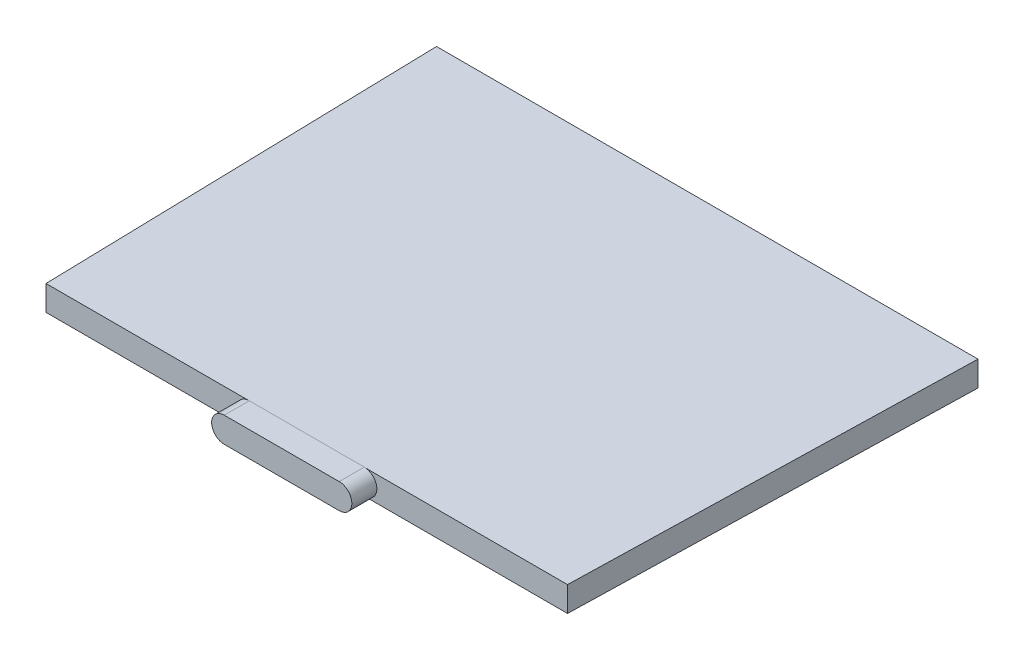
ISO-10303-21;
HEADER;
FILE_DESCRIPTION(('STEP AP214'),'2;1');
FILE_NAME('part.step','',(''),(''),'','','');
FILE_SCHEMA(('AUTOMOTIVE_DESIGN { 1 0 10303 214 1 1 1 1 }'));
ENDSEC;
DATA;
#1=APPLICATION_CONTEXT('core data for automotive mechanical design processes');
#2=APPLICATION_PROTOCOL_DEFINITION('international standard','automotive_design',2000,#1);
#3=PRODUCT_CONTEXT('',#1,'mechanical');
#4=PRODUCT('Part','Part','',(#3));
#5=PRODUCT_RELATED_PRODUCT_CATEGORY('part','',(#4));
#6=PRODUCT_DEFINITION_FORMATION('','',#4);
#7=PRODUCT_DEFINITION_CONTEXT('part definition',#1,'design');
#8=PRODUCT_DEFINITION('design','',#6,#7);
#9=PRODUCT_DEFINITION_SHAPE('','',#8);
#10=(LENGTH_UNIT() NAMED_UNIT(*) SI_UNIT(.MILLI.,.METRE.));
#11=(NAMED_UNIT(*) PLANE_ANGLE_UNIT() SI_UNIT($,.RADIAN.));
#12=(NAMED_UNIT(*) SI_UNIT($,.STERADIAN.) SOLID_ANGLE_UNIT());
#13=UNCERTAINTY_MEASURE_WITH_UNIT(LENGTH_MEASURE(1.E-05),#10,'distance_accuracy_value','');
#14=(GEOMETRIC_REPRESENTATION_CONTEXT(3) GLOBAL_UNCERTAINTY_ASSIGNED_CONTEXT((#13)) GLOBAL_UNIT_ASSIGNED_CONTEXT((#10,
#11,#12)) REPRESENTATION_CONTEXT('',''));
#15=CARTESIAN_POINT('',(0.,0.,0.));
#16=DIRECTION('',(0.,0.,1.));
#17=DIRECTION('',(1.,0.,0.));
#18=AXIS2_PLACEMENT_3D('',#15,#16,#17);
#19=CARTESIAN_POINT('',(-130.22,12.5,200.));
#20=DIRECTION('',(0.,0.,-1.));
#21=DIRECTION('',(-1.,0.,0.));
#22=AXIS2_PLACEMENT_3D('',#19,#20,#21);
#23=PLANE('',#22);
#24=CARTESIAN_POINT('',(-28.7,6.24999999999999,200.));
#25=DIRECTION('',(0.,0.,1.));
#26=DIRECTION('',(1.,0.,0.));
#27=AXIS2_PLACEMENT_3D('',#24,#25,#26);
#28=CIRCLE('',#27,6.3);
#29=CARTESIAN_POINT('',(-29.4921489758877,12.5,200.));
#30=VERTEX_POINT('',#29);
#31=CARTESIAN_POINT('',(-29.4921489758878,0.,200.));
#32=VERTEX_POINT('',#31);
#33=EDGE_CURVE('E11',#30,#32,#28,.T.);
#34=ORIENTED_EDGE('',*,*,#33,.F.);
#35=DIRECTION('',(1.,0.,0.));
#36=VECTOR('',#35,1.);
#37=CARTESIAN_POINT('',(-130.22,12.5,200.));
#38=LINE('',#37,#36);
#39=CARTESIAN_POINT('',(-130.22,12.5,200.));
#40=VERTEX_POINT('',#39);
#41=EDGE_CURVE('E156',#40,#30,#38,.T.);
#42=ORIENTED_EDGE('',*,*,#41,.F.);
#43=DIRECTION('',(0.,-1.,0.));
#44=VECTOR('',#43,1.);
#45=CARTESIAN_POINT('',(-130.22,12.5,200.));
#46=LINE('',#45,#44);
#47=CARTESIAN_POINT('',(-130.22,0.,200.));
#48=VERTEX_POINT('',#47);
#49=EDGE_CURVE('E168',#40,#48,#46,.T.);
#50=ORIENTED_EDGE('',*,*,#49,.T.);
#51=DIRECTION('',(1.,0.,0.));
#52=VECTOR('',#51,1.);
#53=CARTESIAN_POINT('',(-130.22,0.,200.));
#54=LINE('',#53,#52);
#55=EDGE_CURVE('E151',#48,#32,#54,.T.);
#56=ORIENTED_EDGE('',*,*,#55,.T.);
#57=EDGE_LOOP('',(#34,#42,#50,#56));
#58=FACE_BOUND('',#57,.T.);
#59=ADVANCED_FACE('F32',(#58),#23,.F.);
#60=CARTESIAN_POINT('',(135.195,12.5,0.));
#61=DIRECTION('',(-0.999690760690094,0.,-0.0248673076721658));
#62=DIRECTION('',(-0.0248673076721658,0.,0.999690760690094));
#63=AXIS2_PLACEMENT_3D('',#60,#61,#62);
#64=PLANE('',#63);
#65=DIRECTION('',(0.0248673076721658,0.,-0.999690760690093));
#66=VECTOR('',#65,1.);
#67=CARTESIAN_POINT('',(135.195,0.,0.));
#68=LINE('',#67,#66);
#69=CARTESIAN_POINT('',(130.22,0.,200.));
#70=VERTEX_POINT('',#69);
#71=CARTESIAN_POINT('',(135.195,0.,0.));
#72=VERTEX_POINT('',#71);
#73=EDGE_CURVE('E138',#70,#72,#68,.T.);
#74=ORIENTED_EDGE('',*,*,#73,.T.);
#75=DIRECTION('',(0.,-1.,0.));
#76=VECTOR('',#75,1.);
#77=CARTESIAN_POINT('',(135.195,12.5,0.));
#78=LINE('',#77,#76);
#79=CARTESIAN_POINT('',(135.195,12.5,0.));
#80=VERTEX_POINT('',#79);
#81=EDGE_CURVE('E36',#80,#72,#78,.T.);
#82=ORIENTED_EDGE('',*,*,#81,.F.);
#83=DIRECTION('',(0.0248673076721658,0.,-0.999690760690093));
#84=VECTOR('',#83,1.);
#85=CARTESIAN_POINT('',(135.195,12.5,0.));
#86=LINE('',#85,#84);
#87=CARTESIAN_POINT('',(130.22,12.5,200.));
#88=VERTEX_POINT('',#87);
#89=EDGE_CURVE('E147',#88,#80,#86,.T.);
#90=ORIENTED_EDGE('',*,*,#89,.F.);
#91=DIRECTION('',(0.,-1.,0.));
#92=VECTOR('',#91,1.);
#93=CARTESIAN_POINT('',(130.22,12.5,200.));
#94=LINE('',#93,#92);
#95=EDGE_CURVE('E157',#88,#70,#94,.T.);
#96=ORIENTED_EDGE('',*,*,#95,.T.);
#97=EDGE_LOOP('',(#74,#82,#90,#96));
#98=FACE_BOUND('',#97,.T.);
#99=ADVANCED_FACE('F34',(#98),#64,.F.);
#100=CARTESIAN_POINT('',(135.195,12.5,0.));
#101=DIRECTION('',(0.,0.,1.));
#102=DIRECTION('',(1.,0.,0.));
#103=AXIS2_PLACEMENT_3D('',#100,#101,#102);
#104=PLANE('',#103);
#105=DIRECTION('',(-1.,0.,0.));
#106=VECTOR('',#105,1.);
#107=CARTESIAN_POINT('',(135.195,0.,0.));
#108=LINE('',#107,#106);
#109=CARTESIAN_POINT('',(-135.195,0.,0.));
#110=VERTEX_POINT('',#109);
#111=EDGE_CURVE('E141',#72,#110,#108,.T.);
#112=ORIENTED_EDGE('',*,*,#111,.T.);
#113=DIRECTION('',(0.,-1.,0.));
#114=VECTOR('',#113,1.);
#115=CARTESIAN_POINT('',(-135.195,12.5,0.));
#116=LINE('',#115,#114);
#117=CARTESIAN_POINT('',(-135.195,12.5,0.));
#118=VERTEX_POINT('',#117);
#119=EDGE_CURVE('E170',#118,#110,#116,.T.);
#120=ORIENTED_EDGE('',*,*,#119,.F.);
#121=DIRECTION('',(-1.,0.,0.));
#122=VECTOR('',#121,1.);
#123=CARTESIAN_POINT('',(135.195,12.5,0.));
#124=LINE('',#123,#122);
#125=EDGE_CURVE('E150',#80,#118,#124,.T.);
#126=ORIENTED_EDGE('',*,*,#125,.F.);
#127=ORIENTED_EDGE('',*,*,#81,.T.);
#128=EDGE_LOOP('',(#112,#120,#126,#127));
#129=FACE_BOUND('',#128,.T.);
#130=ADVANCED_FACE('F213',(#129),#104,.F.);
#131=CARTESIAN_POINT('',(-135.195,12.5,0.));
#132=DIRECTION('',(0.999690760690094,0.,-0.0248673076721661));
#133=DIRECTION('',(-0.0248673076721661,0.,-0.999690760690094));
#134=AXIS2_PLACEMENT_3D('',#131,#132,#133);
#135=PLANE('',#134);
#136=DIRECTION('',(0.0248673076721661,0.,0.999690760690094));
#137=VECTOR('',#136,1.);
#138=CARTESIAN_POINT('',(-135.195,0.,0.));
#139=LINE('',#138,#137);
#140=EDGE_CURVE('E161',#110,#48,#139,.T.);
#141=ORIENTED_EDGE('',*,*,#140,.T.);
#142=ORIENTED_EDGE('',*,*,#49,.F.);
#143=DIRECTION('',(0.0248673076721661,0.,0.999690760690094));
#144=VECTOR('',#143,1.);
#145=CARTESIAN_POINT('',(-135.195,12.5,0.));
#146=LINE('',#145,#144);
#147=EDGE_CURVE('E153',#118,#40,#146,.T.);
#148=ORIENTED_EDGE('',*,*,#147,.F.);
#149=ORIENTED_EDGE('',*,*,#119,.T.);
#150=EDGE_LOOP('',(#141,#142,#148,#149));
#151=FACE_BOUND('',#150,.T.);
#152=ADVANCED_FACE('F215',(#151),#135,.F.);
#153=CARTESIAN_POINT('',(28.7,6.25,200.));
#154=DIRECTION('',(0.,0.,1.));
#155=DIRECTION('',(1.,0.,0.));
#156=AXIS2_PLACEMENT_3D('',#153,#154,#155);
#157=CIRCLE('',#156,6.3);
#158=CARTESIAN_POINT('',(29.4921489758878,0.,200.));
#159=VERTEX_POINT('',#158);
#160=CARTESIAN_POINT('',(29.4921489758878,12.5,200.));
#161=VERTEX_POINT('',#160);
#162=EDGE_CURVE('E41',#159,#161,#157,.T.);
#163=ORIENTED_EDGE('',*,*,#162,.F.);
#164=EDGE_CURVE('E163',#159,#70,#54,.T.);
#165=ORIENTED_EDGE('',*,*,#164,.T.);
#166=ORIENTED_EDGE('',*,*,#95,.F.);
#167=EDGE_CURVE('E155',#161,#88,#38,.T.);
#168=ORIENTED_EDGE('',*,*,#167,.F.);
#169=EDGE_LOOP('',(#163,#165,#166,#168));
#170=FACE_BOUND('',#169,.T.);
#171=ADVANCED_FACE('F206',(#170),#23,.F.);
#172=CARTESIAN_POINT('',(0.,12.5,0.));
#173=DIRECTION('',(0.,1.,0.));
#174=DIRECTION('',(0.,0.,1.));
#175=AXIS2_PLACEMENT_3D('',#172,#173,#174);
#176=PLANE('',#175);
#177=ORIENTED_EDGE('',*,*,#89,.T.);
#178=ORIENTED_EDGE('',*,*,#125,.T.);
#179=ORIENTED_EDGE('',*,*,#147,.T.);
#180=ORIENTED_EDGE('',*,*,#41,.T.);
#181=EDGE_CURVE('E158',#30,#161,#38,.T.);
#182=ORIENTED_EDGE('',*,*,#181,.T.);
#183=ORIENTED_EDGE('',*,*,#167,.T.);
#184=EDGE_LOOP('',(#177,#178,#179,#180,#182,#183));
#185=FACE_BOUND('',#184,.T.);
#186=ADVANCED_FACE('F204',(#185),#176,.T.);
#187=CARTESIAN_POINT('',(0.,0.,0.));
#188=DIRECTION('',(0.,1.,0.));
#189=DIRECTION('',(0.,0.,1.));
#190=AXIS2_PLACEMENT_3D('',#187,#188,#189);
#191=PLANE('',#190);
#192=ORIENTED_EDGE('',*,*,#73,.F.);
#193=ORIENTED_EDGE('',*,*,#164,.F.);
#194=EDGE_CURVE('E165',#32,#159,#54,.T.);
#195=ORIENTED_EDGE('',*,*,#194,.F.);
#196=ORIENTED_EDGE('',*,*,#55,.F.);
#197=ORIENTED_EDGE('',*,*,#140,.F.);
#198=ORIENTED_EDGE('',*,*,#111,.F.);
#199=EDGE_LOOP('',(#192,#193,#195,#196,#197,#198));
#200=FACE_BOUND('',#199,.T.);
#201=ADVANCED_FACE('F210',(#200),#191,.F.);
#202=CARTESIAN_POINT('',(-28.7,6.24999999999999,200.));
#203=DIRECTION('',(0.,0.,1.));
#204=DIRECTION('',(1.,0.,0.));
#205=AXIS2_PLACEMENT_3D('',#202,#203,#204);
#206=PLANE('',#205);
#207=CARTESIAN_POINT('',(-28.7,-0.0500000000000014,200.));
#208=VERTEX_POINT('',#207);
#209=EDGE_CURVE('E44',#32,#208,#28,.T.);
#210=ORIENTED_EDGE('',*,*,#209,.F.);
#211=ORIENTED_EDGE('',*,*,#194,.T.);
#212=CARTESIAN_POINT('',(28.7,-0.0500000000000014,200.));
#213=VERTEX_POINT('',#212);
#214=EDGE_CURVE('E180',#213,#159,#157,.T.);
#215=ORIENTED_EDGE('',*,*,#214,.F.);
#216=DIRECTION('',(1.,0.,0.));
#217=VECTOR('',#216,1.);
#218=CARTESIAN_POINT('',(-28.7,-0.0500000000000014,200.));
#219=LINE('',#218,#217);
#220=EDGE_CURVE('E186',#208,#213,#219,.T.);
#221=ORIENTED_EDGE('',*,*,#220,.F.);
#222=EDGE_LOOP('',(#210,#211,#215,#221));
#223=FACE_BOUND('',#222,.T.);
#224=ADVANCED_FACE('F218',(#223),#206,.F.);
#225=CARTESIAN_POINT('',(-28.7,6.24999999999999,212.5));
#226=DIRECTION('',(0.,0.,-1.));
#227=DIRECTION('',(-1.,0.,0.));
#228=AXIS2_PLACEMENT_3D('',#225,#226,#227);
#229=CYLINDRICAL_SURFACE('',#228,6.3);
#230=CARTESIAN_POINT('',(-28.7,12.55,200.));
#231=VERTEX_POINT('',#230);
#232=EDGE_CURVE('E43',#231,#30,#28,.T.);
#233=ORIENTED_EDGE('',*,*,#232,.T.);
#234=ORIENTED_EDGE('',*,*,#33,.T.);
#235=ORIENTED_EDGE('',*,*,#209,.T.);
#236=DIRECTION('',(0.,0.,-1.));
#237=VECTOR('',#236,1.);
#238=CARTESIAN_POINT('',(-28.7,-0.0500000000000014,212.5));
#239=LINE('',#238,#237);
#240=CARTESIAN_POINT('',(-28.7,-0.0500000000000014,212.5));
#241=VERTEX_POINT('',#240);
#242=EDGE_CURVE('E117',#241,#208,#239,.T.);
#243=ORIENTED_EDGE('',*,*,#242,.F.);
#244=CARTESIAN_POINT('',(-28.7,6.24999999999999,212.5));
#245=DIRECTION('',(0.,0.,1.));
#246=DIRECTION('',(1.,0.,0.));
#247=AXIS2_PLACEMENT_3D('',#244,#245,#246);
#248=CIRCLE('',#247,6.3);
#249=CARTESIAN_POINT('',(-28.7,12.55,212.5));
#250=VERTEX_POINT('',#249);
#251=EDGE_CURVE('E123',#250,#241,#248,.T.);
#252=ORIENTED_EDGE('',*,*,#251,.F.);
#253=DIRECTION('',(0.,0.,-1.));
#254=VECTOR('',#253,1.);
#255=CARTESIAN_POINT('',(-28.7,12.55,212.5));
#256=LINE('',#255,#254);
#257=EDGE_CURVE('E192',#250,#231,#256,.T.);
#258=ORIENTED_EDGE('',*,*,#257,.T.);
#259=EDGE_LOOP('',(#233,#234,#235,#243,#252,#258));
#260=FACE_BOUND('',#259,.T.);
#261=ADVANCED_FACE('F135',(#260),#229,.T.);
#262=CARTESIAN_POINT('',(-28.7,-0.0500000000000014,212.5));
#263=DIRECTION('',(0.,1.,0.));
#264=DIRECTION('',(-1.,0.,0.));
#265=AXIS2_PLACEMENT_3D('',#262,#263,#264);
#266=PLANE('',#265);
#267=ORIENTED_EDGE('',*,*,#220,.T.);
#268=DIRECTION('',(0.,0.,-1.));
#269=VECTOR('',#268,1.);
#270=CARTESIAN_POINT('',(28.7,-0.0500000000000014,212.5));
#271=LINE('',#270,#269);
#272=CARTESIAN_POINT('',(28.7,-0.0500000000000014,212.5));
#273=VERTEX_POINT('',#272);
#274=EDGE_CURVE('E119',#273,#213,#271,.T.);
#275=ORIENTED_EDGE('',*,*,#274,.F.);
#276=DIRECTION('',(1.,0.,0.));
#277=VECTOR('',#276,1.);
#278=CARTESIAN_POINT('',(-28.7,-0.0500000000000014,212.5));
#279=LINE('',#278,#277);
#280=EDGE_CURVE('E113',#241,#273,#279,.T.);
#281=ORIENTED_EDGE('',*,*,#280,.F.);
#282=ORIENTED_EDGE('',*,*,#242,.T.);
#283=EDGE_LOOP('',(#267,#275,#281,#282));
#284=FACE_BOUND('',#283,.T.);
#285=ADVANCED_FACE('F115',(#284),#266,.F.);
#286=CARTESIAN_POINT('',(28.7,6.25,212.5));
#287=DIRECTION('',(0.,0.,-1.));
#288=DIRECTION('',(-1.,0.,0.));
#289=AXIS2_PLACEMENT_3D('',#286,#287,#288);
#290=CYLINDRICAL_SURFACE('',#289,6.3);
#291=ORIENTED_EDGE('',*,*,#214,.T.);
#292=ORIENTED_EDGE('',*,*,#162,.T.);
#293=CARTESIAN_POINT('',(28.7,12.55,200.));
#294=VERTEX_POINT('',#293);
#295=EDGE_CURVE('E181',#161,#294,#157,.T.);
#296=ORIENTED_EDGE('',*,*,#295,.T.);
#297=DIRECTION('',(0.,0.,-1.));
#298=VECTOR('',#297,1.);
#299=CARTESIAN_POINT('',(28.7,12.55,212.5));
#300=LINE('',#299,#298);
#301=CARTESIAN_POINT('',(28.7,12.55,212.5));
#302=VERTEX_POINT('',#301);
#303=EDGE_CURVE('E143',#302,#294,#300,.T.);
#304=ORIENTED_EDGE('',*,*,#303,.F.);
#305=CARTESIAN_POINT('',(28.7,6.25,212.5));
#306=DIRECTION('',(0.,0.,1.));
#307=DIRECTION('',(1.,0.,0.));
#308=AXIS2_PLACEMENT_3D('',#305,#306,#307);
#309=CIRCLE('',#308,6.3);
#310=EDGE_CURVE('E122',#273,#302,#309,.T.);
#311=ORIENTED_EDGE('',*,*,#310,.F.);
#312=ORIENTED_EDGE('',*,*,#274,.T.);
#313=EDGE_LOOP('',(#291,#292,#296,#304,#311,#312));
#314=FACE_BOUND('',#313,.T.);
#315=ADVANCED_FACE('F193',(#314),#290,.T.);
#316=CARTESIAN_POINT('',(-28.7,12.55,212.5));
#317=DIRECTION('',(0.,-1.,0.));
#318=DIRECTION('',(1.,0.,0.));
#319=AXIS2_PLACEMENT_3D('',#316,#317,#318);
#320=PLANE('',#319);
#321=DIRECTION('',(-1.,0.,0.));
#322=VECTOR('',#321,1.);
#323=CARTESIAN_POINT('',(-28.7,12.55,200.));
#324=LINE('',#323,#322);
#325=EDGE_CURVE('E132',#294,#231,#324,.T.);
#326=ORIENTED_EDGE('',*,*,#325,.T.);
#327=ORIENTED_EDGE('',*,*,#257,.F.);
#328=DIRECTION('',(-1.,0.,0.));
#329=VECTOR('',#328,1.);
#330=CARTESIAN_POINT('',(-28.7,12.55,212.5));
#331=LINE('',#330,#329);
#332=EDGE_CURVE('E128',#302,#250,#331,.T.);
#333=ORIENTED_EDGE('',*,*,#332,.F.);
#334=ORIENTED_EDGE('',*,*,#303,.T.);
#335=EDGE_LOOP('',(#326,#327,#333,#334));
#336=FACE_BOUND('',#335,.T.);
#337=ADVANCED_FACE('F196',(#336),#320,.F.);
#338=CARTESIAN_POINT('',(-28.7,6.24999999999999,212.5));
#339=DIRECTION('',(0.,0.,1.));
#340=DIRECTION('',(1.,0.,0.));
#341=AXIS2_PLACEMENT_3D('',#338,#339,#340);
#342=PLANE('',#341);
#343=ORIENTED_EDGE('',*,*,#251,.T.);
#344=ORIENTED_EDGE('',*,*,#280,.T.);
#345=ORIENTED_EDGE('',*,*,#310,.T.);
#346=ORIENTED_EDGE('',*,*,#332,.T.);
#347=EDGE_LOOP('',(#343,#344,#345,#346));
#348=FACE_BOUND('',#347,.T.);
#349=ADVANCED_FACE('F126',(#348),#342,.T.);
#350=ORIENTED_EDGE('',*,*,#181,.F.);
#351=ORIENTED_EDGE('',*,*,#232,.F.);
#352=ORIENTED_EDGE('',*,*,#325,.F.);
#353=ORIENTED_EDGE('',*,*,#295,.F.);
#354=EDGE_LOOP('',(#350,#351,#352,#353));
#355=FACE_BOUND('',#354,.T.);
#356=ADVANCED_FACE('F201',(#355),#206,.F.);
#357=CLOSED_SHELL('',(#59,#99,#130,#152,#171,#186,#201,#224,#261,#285,#315,#337,#349,#356));
#358=MANIFOLD_SOLID_BREP('B2',#357);
#359=ADVANCED_BREP_SHAPE_REPRESENTATION('',(#18,#358),#14);
#360=SHAPE_DEFINITION_REPRESENTATION(#9,#359);
ENDSEC;
END-ISO-10303-21;
